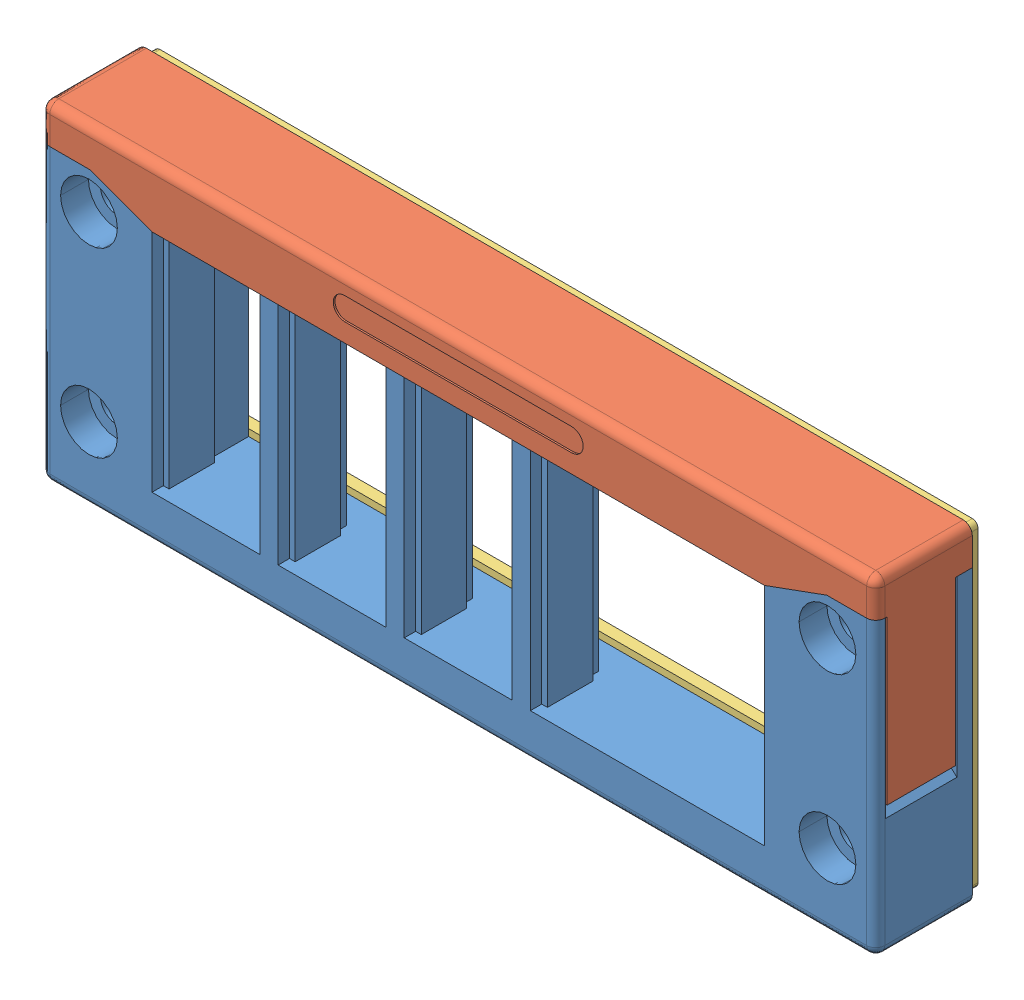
SolidWorks assembly 42412.SLDASM, configuration Default (file format 8000). Lengths in mm.
Overall size (147 58 19).
3 component instances, 3 part files, 0 mates.
Components (placement in the parent):
- 42412_01-1: 42412_01.SLDPRT [Default] at origin size (147 51.5 17)
- 42412_02-1: 42412_02.SLDPRT [Default] at origin size (147 35.2 17)
- 42412_03-1: 42412_03.SLDPRT [Default] at origin size (145 56 2)
